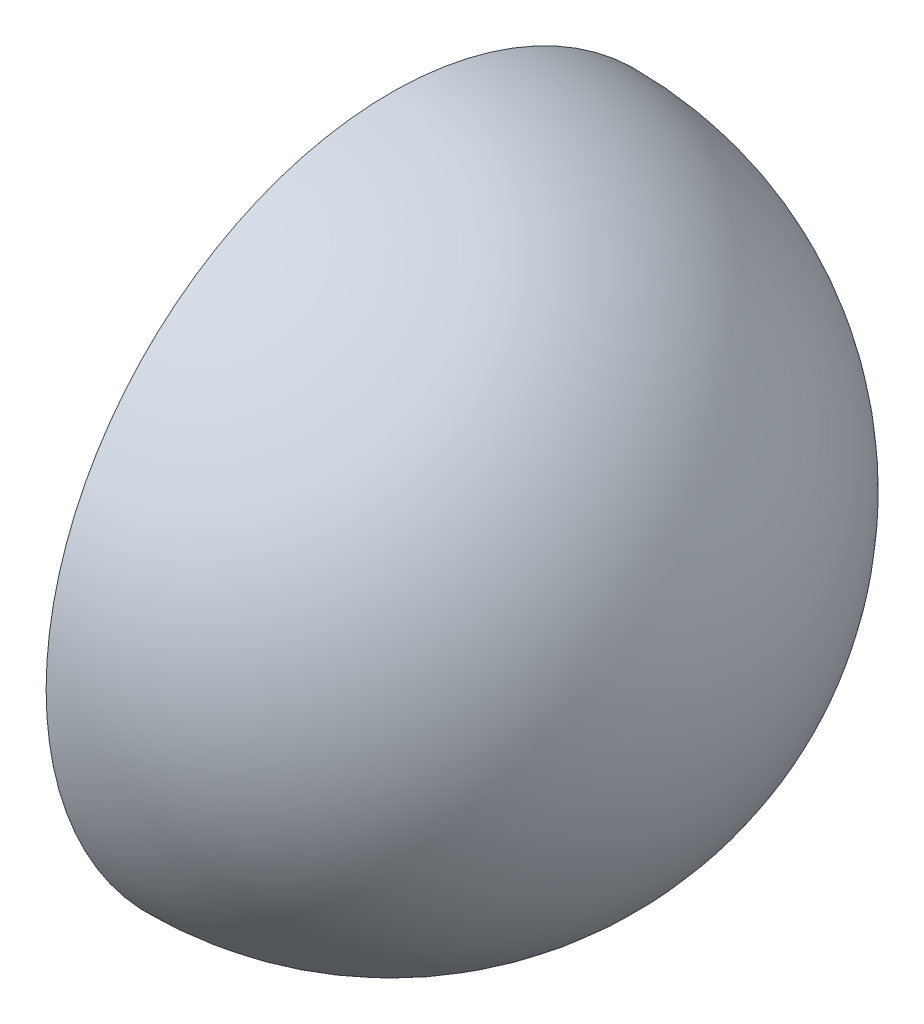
ISO-10303-21;
HEADER;
FILE_DESCRIPTION(('STEP AP214'),'2;1');
FILE_NAME('part.step','',(''),(''),'','','');
FILE_SCHEMA(('AUTOMOTIVE_DESIGN { 1 0 10303 214 1 1 1 1 }'));
ENDSEC;
DATA;
#1=APPLICATION_CONTEXT('core data for automotive mechanical design processes');
#2=APPLICATION_PROTOCOL_DEFINITION('international standard','automotive_design',2000,#1);
#3=PRODUCT_CONTEXT('',#1,'mechanical');
#4=PRODUCT('Part','Part','',(#3));
#5=PRODUCT_RELATED_PRODUCT_CATEGORY('part','',(#4));
#6=PRODUCT_DEFINITION_FORMATION('','',#4);
#7=PRODUCT_DEFINITION_CONTEXT('part definition',#1,'design');
#8=PRODUCT_DEFINITION('design','',#6,#7);
#9=PRODUCT_DEFINITION_SHAPE('','',#8);
#10=(LENGTH_UNIT() NAMED_UNIT(*) SI_UNIT(.MILLI.,.METRE.));
#11=(NAMED_UNIT(*) PLANE_ANGLE_UNIT() SI_UNIT($,.RADIAN.));
#12=(NAMED_UNIT(*) SI_UNIT($,.STERADIAN.) SOLID_ANGLE_UNIT());
#13=UNCERTAINTY_MEASURE_WITH_UNIT(LENGTH_MEASURE(1.E-05),#10,'distance_accuracy_value','');
#14=(GEOMETRIC_REPRESENTATION_CONTEXT(3) GLOBAL_UNCERTAINTY_ASSIGNED_CONTEXT((#13)) GLOBAL_UNIT_ASSIGNED_CONTEXT((#10,
#11,#12)) REPRESENTATION_CONTEXT('',''));
#15=CARTESIAN_POINT('',(0.,0.,0.));
#16=DIRECTION('',(0.,0.,1.));
#17=DIRECTION('',(1.,0.,0.));
#18=AXIS2_PLACEMENT_3D('',#15,#16,#17);
#19=CARTESIAN_POINT('',(0.,0.,0.));
#20=DIRECTION('',(0.,-1.,0.));
#21=DIRECTION('',(0.,0.,1.));
#22=AXIS2_PLACEMENT_3D('',#19,#20,#21);
#23=SPHERICAL_SURFACE('',#22,76.2);
#24=CARTESIAN_POINT('',(0.,0.,0.));
#25=DIRECTION('',(1.,0.,0.));
#26=DIRECTION('',(0.,0.,1.));
#27=AXIS2_PLACEMENT_3D('',#24,#25,#26);
#28=SPHERICAL_SURFACE('',#27,76.2);
#29=CARTESIAN_POINT('',(0.,0.,0.));
#30=DIRECTION('',(1.,0.,0.));
#31=DIRECTION('',(0.,0.,1.));
#32=AXIS2_PLACEMENT_3D('',#29,#30,#31);
#33=CIRCLE('',#32,76.2);
#34=CARTESIAN_POINT('',(5.32101756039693E-13,0.,76.2));
#35=VERTEX_POINT('',#34);
#36=EDGE_CURVE('E38',#35,#35,#33,.T.);
#37=ORIENTED_EDGE('',*,*,#36,.F.);
#38=EDGE_LOOP('',(#37));
#39=FACE_BOUND('',#38,.T.);
#40=ADVANCED_FACE('F31',(#39),#28,.F.);
#41=CARTESIAN_POINT('',(0.,0.,0.));
#42=DIRECTION('',(0.,-1.,0.));
#43=DIRECTION('',(0.,0.,1.));
#44=AXIS2_PLACEMENT_3D('',#41,#42,#43);
#45=SPHERICAL_SURFACE('',#44,101.6);
#46=CARTESIAN_POINT('',(0.,0.,0.));
#47=DIRECTION('',(-1.,0.,0.));
#48=DIRECTION('',(0.,0.,1.));
#49=AXIS2_PLACEMENT_3D('',#46,#47,#48);
#50=SPHERICAL_SURFACE('',#49,101.6);
#51=CARTESIAN_POINT('',(0.,0.,0.));
#52=DIRECTION('',(-1.,0.,0.));
#53=DIRECTION('',(0.,0.,1.));
#54=AXIS2_PLACEMENT_3D('',#51,#52,#53);
#55=CIRCLE('',#54,101.6);
#56=CARTESIAN_POINT('',(7.09469008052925E-13,0.,101.6));
#57=VERTEX_POINT('',#56);
#58=EDGE_CURVE('E10',#57,#57,#55,.T.);
#59=ORIENTED_EDGE('',*,*,#58,.F.);
#60=EDGE_LOOP('',(#59));
#61=FACE_BOUND('',#60,.T.);
#62=ADVANCED_FACE('F33',(#61),#50,.T.);
#63=CARTESIAN_POINT('',(0.,0.,0.));
#64=DIRECTION('',(-1.,0.,0.));
#65=DIRECTION('',(0.,0.,1.));
#66=AXIS2_PLACEMENT_3D('',#63,#64,#65);
#67=PLANE('',#66);
#68=ORIENTED_EDGE('',*,*,#58,.T.);
#69=EDGE_LOOP('',(#68));
#70=FACE_BOUND('',#69,.T.);
#71=ORIENTED_EDGE('',*,*,#36,.T.);
#72=EDGE_LOOP('',(#71));
#73=FACE_BOUND('',#72,.T.);
#74=ADVANCED_FACE('F44',(#70,#73),#67,.T.);
#75=CLOSED_SHELL('',(#40,#62,#74));
#76=MANIFOLD_SOLID_BREP('B2',#75);
#77=ADVANCED_BREP_SHAPE_REPRESENTATION('',(#18,#76),#14);
#78=SHAPE_DEFINITION_REPRESENTATION(#9,#77);
ENDSEC;
END-ISO-10303-21;
